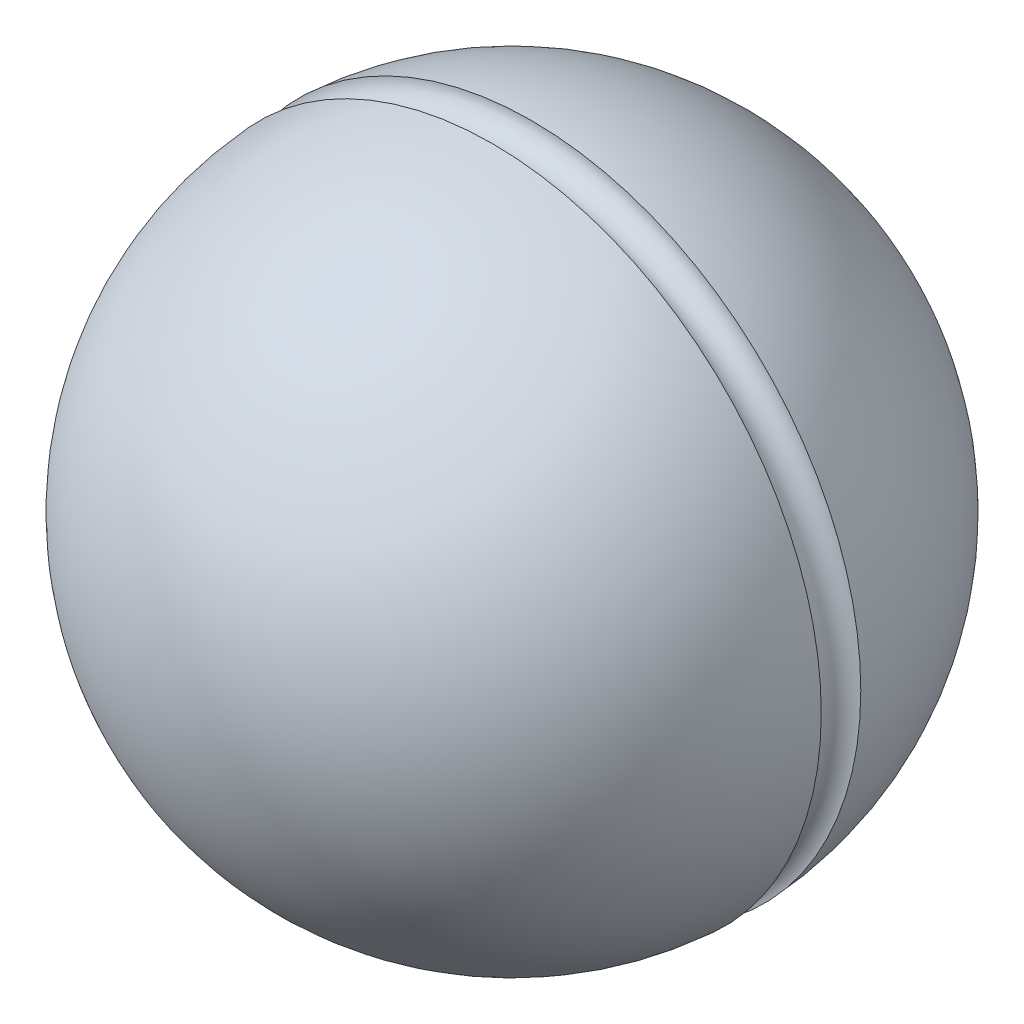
ISO-10303-21;
HEADER;
FILE_DESCRIPTION(('STEP AP214'),'2;1');
FILE_NAME('part.step','',(''),(''),'','','');
FILE_SCHEMA(('AUTOMOTIVE_DESIGN { 1 0 10303 214 1 1 1 1 }'));
ENDSEC;
DATA;
#1=APPLICATION_CONTEXT('core data for automotive mechanical design processes');
#2=APPLICATION_PROTOCOL_DEFINITION('international standard','automotive_design',2000,#1);
#3=PRODUCT_CONTEXT('',#1,'mechanical');
#4=PRODUCT('Part','Part','',(#3));
#5=PRODUCT_RELATED_PRODUCT_CATEGORY('part','',(#4));
#6=PRODUCT_DEFINITION_FORMATION('','',#4);
#7=PRODUCT_DEFINITION_CONTEXT('part definition',#1,'design');
#8=PRODUCT_DEFINITION('design','',#6,#7);
#9=PRODUCT_DEFINITION_SHAPE('','',#8);
#10=(LENGTH_UNIT() NAMED_UNIT(*) SI_UNIT(.MILLI.,.METRE.));
#11=(NAMED_UNIT(*) PLANE_ANGLE_UNIT() SI_UNIT($,.RADIAN.));
#12=(NAMED_UNIT(*) SI_UNIT($,.STERADIAN.) SOLID_ANGLE_UNIT());
#13=UNCERTAINTY_MEASURE_WITH_UNIT(LENGTH_MEASURE(1.E-05),#10,'distance_accuracy_value','');
#14=(GEOMETRIC_REPRESENTATION_CONTEXT(3) GLOBAL_UNCERTAINTY_ASSIGNED_CONTEXT((#13)) GLOBAL_UNIT_ASSIGNED_CONTEXT((#10,
#11,#12)) REPRESENTATION_CONTEXT('',''));
#15=CARTESIAN_POINT('',(0.,0.,0.));
#16=DIRECTION('',(0.,0.,1.));
#17=DIRECTION('',(1.,0.,0.));
#18=AXIS2_PLACEMENT_3D('',#15,#16,#17);
#19=CARTESIAN_POINT('',(4.,0.,13.9999999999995));
#20=DIRECTION('',(0.,0.,-1.));
#21=DIRECTION('',(0.,1.,0.));
#22=AXIS2_PLACEMENT_3D('',#19,#20,#21);
#23=PLANE('',#22);
#24=CARTESIAN_POINT('',(0.,0.,13.9999999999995));
#25=DIRECTION('',(0.,0.,-1.));
#26=DIRECTION('',(0.,1.,0.));
#27=AXIS2_PLACEMENT_3D('',#24,#25,#26);
#28=CIRCLE('',#27,4.);
#29=CARTESIAN_POINT('',(0.,4.,13.9999999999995));
#30=VERTEX_POINT('',#29);
#31=EDGE_CURVE('E8',#30,#30,#28,.T.);
#32=ORIENTED_EDGE('',*,*,#31,.T.);
#33=EDGE_LOOP('',(#32));
#34=FACE_BOUND('',#33,.T.);
#35=ADVANCED_FACE('F12',(#34),#23,.T.);
#36=CARTESIAN_POINT('',(0.,0.,0.));
#37=DIRECTION('',(0.,0.,-1.));
#38=DIRECTION('',(0.,1.,0.));
#39=AXIS2_PLACEMENT_3D('',#36,#37,#38);
#40=CYLINDRICAL_SURFACE('',#39,4.);
#41=CARTESIAN_POINT('',(0.,0.,0.));
#42=DIRECTION('',(0.,0.,-1.));
#43=DIRECTION('',(0.,1.,0.));
#44=AXIS2_PLACEMENT_3D('',#41,#42,#43);
#45=CIRCLE('',#44,4.);
#46=CARTESIAN_POINT('',(0.,4.,0.));
#47=VERTEX_POINT('',#46);
#48=EDGE_CURVE('E18',#47,#47,#45,.T.);
#49=ORIENTED_EDGE('',*,*,#48,.T.);
#50=EDGE_LOOP('',(#49));
#51=FACE_BOUND('',#50,.T.);
#52=ORIENTED_EDGE('',*,*,#31,.F.);
#53=EDGE_LOOP('',(#52));
#54=FACE_BOUND('',#53,.T.);
#55=ADVANCED_FACE('F48',(#51,#54),#40,.F.);
#56=CARTESIAN_POINT('',(4.89897948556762,0.,0.));
#57=DIRECTION('',(0.,0.,-1.));
#58=DIRECTION('',(0.,1.,0.));
#59=AXIS2_PLACEMENT_3D('',#56,#57,#58);
#60=PLANE('',#59);
#61=CARTESIAN_POINT('',(0.,0.,0.));
#62=DIRECTION('',(0.,0.,-1.));
#63=DIRECTION('',(0.,1.,0.));
#64=AXIS2_PLACEMENT_3D('',#61,#62,#63);
#65=CIRCLE('',#64,4.89897948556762);
#66=CARTESIAN_POINT('',(4.89897948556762,0.,0.));
#67=VERTEX_POINT('',#66);
#68=EDGE_CURVE('E22',#67,#67,#65,.T.);
#69=ORIENTED_EDGE('',*,*,#68,.T.);
#70=EDGE_LOOP('',(#69));
#71=FACE_BOUND('',#70,.T.);
#72=ORIENTED_EDGE('',*,*,#48,.F.);
#73=EDGE_LOOP('',(#72));
#74=FACE_BOUND('',#73,.T.);
#75=ADVANCED_FACE('F52',(#71,#74),#60,.T.);
#76=CARTESIAN_POINT('',(0.,0.,11.4999999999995));
#77=DIRECTION('',(0.,0.,-1.));
#78=DIRECTION('',(1.,0.,0.));
#79=AXIS2_PLACEMENT_3D('',#76,#77,#78);
#80=SPHERICAL_SURFACE('',#79,12.5);
#81=CARTESIAN_POINT('',(0.,0.,10.7503375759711));
#82=DIRECTION('',(0.,0.,-1.));
#83=DIRECTION('',(0.,1.,0.));
#84=AXIS2_PLACEMENT_3D('',#81,#82,#83);
#85=CIRCLE('',#84,12.4775);
#86=CARTESIAN_POINT('',(12.4775,0.,10.7503375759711));
#87=VERTEX_POINT('',#86);
#88=EDGE_CURVE('E26',#87,#87,#85,.T.);
#89=CARTESIAN_POINT('',(12.4775,0.,10.7503375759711));
#90=CARTESIAN_POINT('',(12.4688481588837,0.,10.6063170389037));
#91=CARTESIAN_POINT('',(12.4577006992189,0.,10.4624465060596));
#92=CARTESIAN_POINT('',(12.4304326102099,0.,10.1751774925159));
#93=CARTESIAN_POINT('',(12.4143119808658,0.,10.0317790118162));
#94=CARTESIAN_POINT('',(12.3771156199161,0.,9.74562614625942));
#95=CARTESIAN_POINT('',(12.3560398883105,0.,9.60287176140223));
#96=CARTESIAN_POINT('',(12.3089589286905,0.,9.31817820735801));
#97=CARTESIAN_POINT('',(12.2829537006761,0.,9.17623903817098));
#98=CARTESIAN_POINT('',(12.2260448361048,0.,8.89334609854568));
#99=CARTESIAN_POINT('',(12.1951411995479,0.,8.75239232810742));
#100=CARTESIAN_POINT('',(12.1284725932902,0.,8.47163917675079));
#101=CARTESIAN_POINT('',(12.0927076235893,0.,8.33183979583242));
#102=CARTESIAN_POINT('',(12.0163592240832,0.,8.05356303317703));
#103=CARTESIAN_POINT('',(11.9757757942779,0.,7.91508565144));
#104=CARTESIAN_POINT('',(11.889839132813,0.,7.63961891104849));
#105=CARTESIAN_POINT('',(11.8444859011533,0.,7.50262955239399));
#106=CARTESIAN_POINT('',(11.7490640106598,0.,7.23030309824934));
#107=CARTESIAN_POINT('',(11.698995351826,0.,7.09496600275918));
#108=CARTESIAN_POINT('',(11.5942026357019,0.,6.82610633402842));
#109=CARTESIAN_POINT('',(11.5394785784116,0.,6.69258376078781));
#110=CARTESIAN_POINT('',(11.4254406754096,0.,6.42751322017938));
#111=CARTESIAN_POINT('',(11.3661268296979,0.,6.29596525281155));
#112=CARTESIAN_POINT('',(11.2429804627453,0.,6.0350016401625));
#113=CARTESIAN_POINT('',(11.1791479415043,0.,5.90558599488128));
#114=CARTESIAN_POINT('',(11.0470407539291,0.,5.649042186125));
#115=CARTESIAN_POINT('',(10.9787660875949,0.,5.52191402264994));
#116=CARTESIAN_POINT('',(10.8378564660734,0.,5.27009759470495));
#117=CARTESIAN_POINT('',(10.7652215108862,0.,5.14540933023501));
#118=CARTESIAN_POINT('',(10.6156783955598,0.,4.89862219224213));
#119=CARTESIAN_POINT('',(10.5387702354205,0.,4.77652331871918));
#120=CARTESIAN_POINT('',(10.3807729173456,0.,4.53506135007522));
#121=CARTESIAN_POINT('',(10.29968375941,0.,4.41569825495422));
#122=CARTESIAN_POINT('',(10.1334216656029,0.,4.1798509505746));
#123=CARTESIAN_POINT('',(10.0482487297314,0.,4.06336674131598));
#124=CARTESIAN_POINT('',(9.8739211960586,0.,3.83341686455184));
#125=CARTESIAN_POINT('',(9.78476659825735,0.,3.71995119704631));
#126=CARTESIAN_POINT('',(9.60258263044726,0.,3.49617444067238));
#127=CARTESIAN_POINT('',(9.50955326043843,0.,3.38586335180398));
#128=CARTESIAN_POINT('',(9.31973128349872,0.,3.1685280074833));
#129=CARTESIAN_POINT('',(9.22293867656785,0.,3.06150375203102));
#130=CARTESIAN_POINT('',(9.02570627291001,0.,2.85087038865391));
#131=CARTESIAN_POINT('',(8.92526647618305,0.,2.74726128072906));
#132=CARTESIAN_POINT('',(8.7208601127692,0.,2.54358243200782));
#133=CARTESIAN_POINT('',(8.61689354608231,0.,2.44351269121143));
#134=CARTESIAN_POINT('',(8.40555829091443,0.,2.24703255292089));
#135=CARTESIAN_POINT('',(8.29818960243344,0.,2.15062215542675));
#136=CARTESIAN_POINT('',(8.08017883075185,0.,1.96157629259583));
#137=CARTESIAN_POINT('',(7.96953674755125,0.,1.86894082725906));
#138=CARTESIAN_POINT('',(7.74511183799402,0.,1.68755589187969));
#139=CARTESIAN_POINT('',(7.63132901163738,0.,1.5988064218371));
#140=CARTESIAN_POINT('',(7.40075903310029,0.,1.42529988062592));
#141=CARTESIAN_POINT('',(7.28397188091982,0.,1.34054280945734));
#142=CARTESIAN_POINT('',(7.04753326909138,0.,1.17512268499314));
#143=CARTESIAN_POINT('',(6.9278818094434,0.,1.09445963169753));
#144=CARTESIAN_POINT('',(6.68585803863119,0.,0.937324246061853));
#145=CARTESIAN_POINT('',(6.56348572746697,0.,0.860851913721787));
#146=CARTESIAN_POINT('',(6.316166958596,0.,0.712189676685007));
#147=CARTESIAN_POINT('',(6.19122050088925,0.,0.639999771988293));
#148=CARTESIAN_POINT('',(5.93890327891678,0.,0.499988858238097));
#149=CARTESIAN_POINT('',(5.81153251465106,0.,0.432167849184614));
#150=CARTESIAN_POINT('',(5.55451924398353,0.,0.300976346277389));
#151=CARTESIAN_POINT('',(5.42487673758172,0.,0.237605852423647));
#152=CARTESIAN_POINT('',(5.16347595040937,0.,0.11539020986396));
#153=CARTESIAN_POINT('',(5.03171766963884,0.,0.0565450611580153));
#154=CARTESIAN_POINT('',(4.89897948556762,0.,0.));
#155=B_SPLINE_CURVE_WITH_KNOTS('',3,(#89,#90,#91,#92,#93,#94,#95,#96,#97,#98,#99,#100,#101,#102,
#103,#104,#105,#106,#107,#108,#109,#110,#111,#112,#113,#114,#115,#116,#117,#118,#119,#120,#121,
#122,#123,#124,#125,#126,#127,#128,#129,#130,#131,#132,#133,#134,#135,#136,#137,#138,#139,#140,
#141,#142,#143,#144,#145,#146,#147,#148,#149,#150,#151,#152,#153,#154),.UNSPECIFIED.,.F.,.F.,(4,
2,2,2,2,2,2,2,2,2,2,2,2,2,2,2,2,2,2,2,2,2,2,2,2,2,2,2,2,2,2,2,4),(0.,0.432818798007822,
0.865637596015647,1.29845639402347,1.73127519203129,2.16409399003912,2.59691278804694,
3.02973158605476,3.46255038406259,3.89536918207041,4.32818798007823,4.76100677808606,
5.19382557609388,5.6266443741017,6.05946317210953,6.49228197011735,6.92510076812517,
7.357919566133,7.79073836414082,8.22355716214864,8.65637596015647,9.08919475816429,
9.52201355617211,9.95483235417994,10.3876511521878,10.8204699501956,11.2532887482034,
11.6861075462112,12.1189263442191,12.5517451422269,12.9845639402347,13.4173827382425,
13.8502015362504),.UNSPECIFIED.);
#156=EDGE_CURVE('BSEAM45',#87,#67,#155,.T.);
#157=ORIENTED_EDGE('',*,*,#88,.T.);
#158=ORIENTED_EDGE('',*,*,#68,.F.);
#159=ORIENTED_EDGE('',*,*,#156,.T.);
#160=ORIENTED_EDGE('',*,*,#156,.F.);
#161=EDGE_LOOP('',(#157,#159,#158,#160));
#162=FACE_BOUND('',#161,.T.);
#163=ADVANCED_FACE('F45',(#162),#80,.T.);
#164=CARTESIAN_POINT('',(0.,0.,11.4999999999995));
#165=DIRECTION('',(0.,0.,-1.));
#166=DIRECTION('',(0.,1.,0.));
#167=AXIS2_PLACEMENT_3D('',#164,#165,#166);
#168=TOROIDAL_SURFACE('',#167,12.5,0.750000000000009);
#169=CARTESIAN_POINT('',(0.,0.,12.2496624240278));
#170=DIRECTION('',(0.,0.,-1.));
#171=DIRECTION('',(0.,1.,0.));
#172=AXIS2_PLACEMENT_3D('',#169,#170,#171);
#173=CIRCLE('',#172,12.4775);
#174=CARTESIAN_POINT('',(0.,12.4775,12.2496624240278));
#175=VERTEX_POINT('',#174);
#176=EDGE_CURVE('E31',#175,#175,#173,.T.);
#177=ORIENTED_EDGE('',*,*,#176,.T.);
#178=EDGE_LOOP('',(#177));
#179=FACE_BOUND('',#178,.T.);
#180=ORIENTED_EDGE('',*,*,#88,.F.);
#181=EDGE_LOOP('',(#180));
#182=FACE_BOUND('',#181,.T.);
#183=ADVANCED_FACE('F35',(#179,#182),#168,.F.);
#184=CARTESIAN_POINT('',(0.,0.,11.4999999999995));
#185=DIRECTION('',(0.,0.,-1.));
#186=DIRECTION('',(1.,0.,0.));
#187=AXIS2_PLACEMENT_3D('',#184,#185,#186);
#188=SPHERICAL_SURFACE('',#187,12.5);
#189=ORIENTED_EDGE('',*,*,#176,.F.);
#190=EDGE_LOOP('',(#189));
#191=FACE_BOUND('',#190,.T.);
#192=ADVANCED_FACE('F38',(#191),#188,.T.);
#193=CLOSED_SHELL('',(#35,#55,#75,#163,#183,#192));
#194=MANIFOLD_SOLID_BREP('B1',#193);
#195=ADVANCED_BREP_SHAPE_REPRESENTATION('',(#18,#194),#14);
#196=SHAPE_DEFINITION_REPRESENTATION(#9,#195);
ENDSEC;
END-ISO-10303-21;
